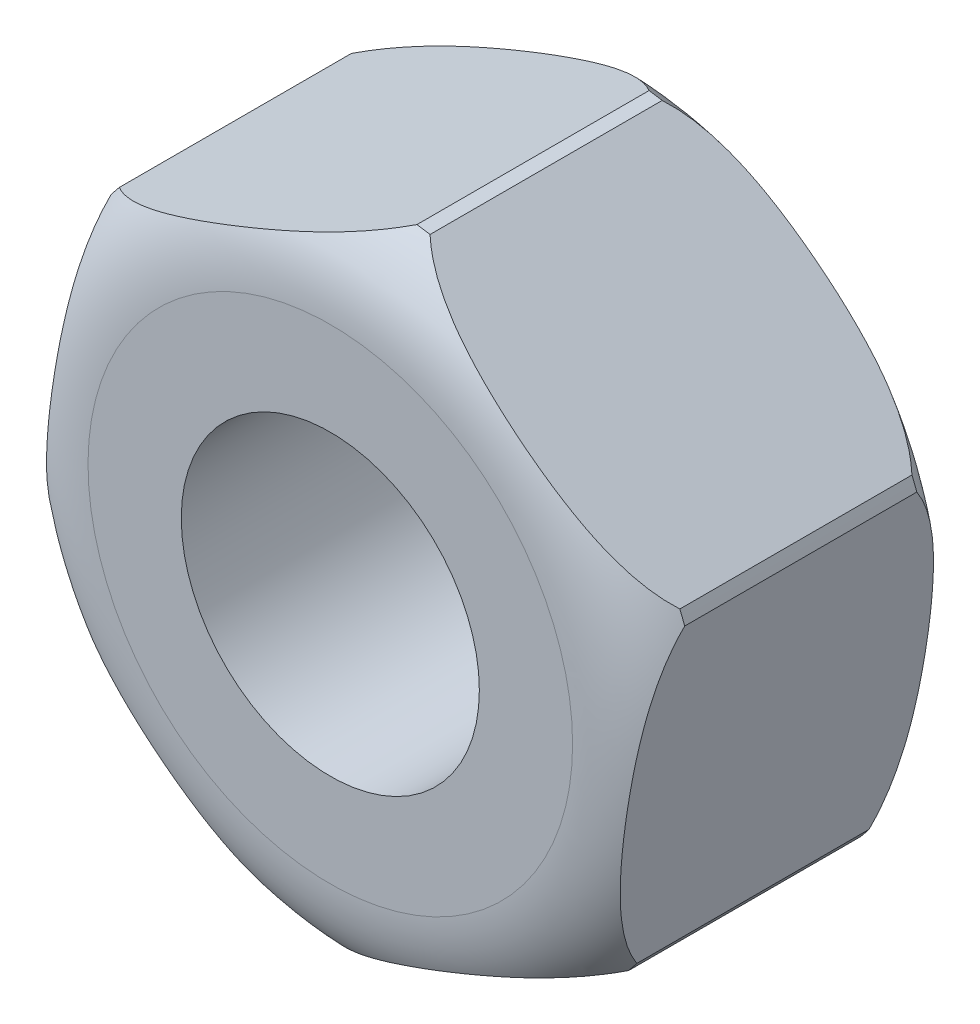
ISO-10303-21;
HEADER;
FILE_DESCRIPTION(('STEP AP214'),'2;1');
FILE_NAME('part.step','',(''),(''),'','','');
FILE_SCHEMA(('AUTOMOTIVE_DESIGN { 1 0 10303 214 1 1 1 1 }'));
ENDSEC;
DATA;
#1=APPLICATION_CONTEXT('core data for automotive mechanical design processes');
#2=APPLICATION_PROTOCOL_DEFINITION('international standard','automotive_design',2000,#1);
#3=PRODUCT_CONTEXT('',#1,'mechanical');
#4=PRODUCT('Part','Part','',(#3));
#5=PRODUCT_RELATED_PRODUCT_CATEGORY('part','',(#4));
#6=PRODUCT_DEFINITION_FORMATION('','',#4);
#7=PRODUCT_DEFINITION_CONTEXT('part definition',#1,'design');
#8=PRODUCT_DEFINITION('design','',#6,#7);
#9=PRODUCT_DEFINITION_SHAPE('','',#8);
#10=(LENGTH_UNIT() NAMED_UNIT(*) SI_UNIT(.MILLI.,.METRE.));
#11=(NAMED_UNIT(*) PLANE_ANGLE_UNIT() SI_UNIT($,.RADIAN.));
#12=(NAMED_UNIT(*) SI_UNIT($,.STERADIAN.) SOLID_ANGLE_UNIT());
#13=UNCERTAINTY_MEASURE_WITH_UNIT(LENGTH_MEASURE(1.E-05),#10,'distance_accuracy_value','');
#14=(GEOMETRIC_REPRESENTATION_CONTEXT(3) GLOBAL_UNCERTAINTY_ASSIGNED_CONTEXT((#13)) GLOBAL_UNIT_ASSIGNED_CONTEXT((#10,
#11,#12)) REPRESENTATION_CONTEXT('',''));
#15=CARTESIAN_POINT('',(0.,0.,0.));
#16=DIRECTION('',(0.,0.,1.));
#17=DIRECTION('',(1.,0.,0.));
#18=AXIS2_PLACEMENT_3D('',#15,#16,#17);
#19=CARTESIAN_POINT('',(0.,0.,3.));
#20=DIRECTION('',(0.,0.,1.));
#21=DIRECTION('',(1.,0.,0.));
#22=AXIS2_PLACEMENT_3D('',#19,#20,#21);
#23=PLANE('',#22);
#24=CARTESIAN_POINT('',(0.,0.,3.));
#25=DIRECTION('',(0.,0.,1.));
#26=DIRECTION('',(1.,0.,0.));
#27=AXIS2_PLACEMENT_3D('',#24,#25,#26);
#28=CIRCLE('',#27,1.4);
#29=CARTESIAN_POINT('',(1.4,0.,3.));
#30=VERTEX_POINT('',#29);
#31=EDGE_CURVE('E254',#30,#30,#28,.T.);
#32=ORIENTED_EDGE('',*,*,#31,.F.);
#33=EDGE_LOOP('',(#32));
#34=FACE_BOUND('',#33,.T.);
#35=CARTESIAN_POINT('',(0.,0.,3.));
#36=DIRECTION('',(0.,0.,1.));
#37=DIRECTION('',(1.,0.,0.));
#38=AXIS2_PLACEMENT_3D('',#35,#36,#37);
#39=CIRCLE('',#38,2.27578255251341);
#40=CARTESIAN_POINT('',(2.27578255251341,0.,3.));
#41=VERTEX_POINT('',#40);
#42=EDGE_CURVE('E175',#41,#41,#39,.T.);
#43=ORIENTED_EDGE('',*,*,#42,.T.);
#44=EDGE_LOOP('',(#43));
#45=FACE_BOUND('',#44,.T.);
#46=ADVANCED_FACE('F48',(#34,#45),#23,.T.);
#47=CARTESIAN_POINT('',(0.,0.,0.));
#48=DIRECTION('',(0.,0.,1.));
#49=DIRECTION('',(1.,0.,0.));
#50=AXIS2_PLACEMENT_3D('',#47,#48,#49);
#51=PLANE('',#50);
#52=CARTESIAN_POINT('',(0.,0.,0.));
#53=DIRECTION('',(0.,0.,1.));
#54=DIRECTION('',(1.,0.,0.));
#55=AXIS2_PLACEMENT_3D('',#52,#53,#54);
#56=CIRCLE('',#55,1.4);
#57=CARTESIAN_POINT('',(1.4,0.,0.));
#58=VERTEX_POINT('',#57);
#59=EDGE_CURVE('E260',#58,#58,#56,.T.);
#60=ORIENTED_EDGE('',*,*,#59,.T.);
#61=EDGE_LOOP('',(#60));
#62=FACE_BOUND('',#61,.T.);
#63=CARTESIAN_POINT('',(0.,0.,0.));
#64=DIRECTION('',(0.,0.,1.));
#65=DIRECTION('',(1.,0.,0.));
#66=AXIS2_PLACEMENT_3D('',#63,#64,#65);
#67=CIRCLE('',#66,2.27578255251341);
#68=CARTESIAN_POINT('',(2.27578255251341,0.,0.));
#69=VERTEX_POINT('',#68);
#70=EDGE_CURVE('E162',#69,#69,#67,.T.);
#71=ORIENTED_EDGE('',*,*,#70,.F.);
#72=EDGE_LOOP('',(#71));
#73=FACE_BOUND('',#72,.T.);
#74=ADVANCED_FACE('F402',(#62,#73),#51,.F.);
#75=CARTESIAN_POINT('',(0.,0.,0.));
#76=DIRECTION('',(0.,0.,1.));
#77=DIRECTION('',(1.,0.,0.));
#78=AXIS2_PLACEMENT_3D('',#75,#76,#77);
#79=CYLINDRICAL_SURFACE('',#78,1.4);
#80=ORIENTED_EDGE('',*,*,#59,.F.);
#81=EDGE_LOOP('',(#80));
#82=FACE_BOUND('',#81,.T.);
#83=ORIENTED_EDGE('',*,*,#31,.T.);
#84=EDGE_LOOP('',(#83));
#85=FACE_BOUND('',#84,.T.);
#86=ADVANCED_FACE('F409',(#82,#85),#79,.F.);
#87=CARTESIAN_POINT('',(0.,0.,3.));
#88=DIRECTION('',(0.,0.,1.));
#89=DIRECTION('',(1.,0.,0.));
#90=AXIS2_PLACEMENT_3D('',#87,#88,#89);
#91=CYLINDRICAL_SURFACE('',#90,3.11115542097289);
#92=DIRECTION('',(0.,0.,1.));
#93=VECTOR('',#92,1.);
#94=CARTESIAN_POINT('',(0.403593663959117,3.08486631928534,3.));
#95=LINE('',#94,#93);
#96=CARTESIAN_POINT('',(0.403593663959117,3.08486631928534,0.409852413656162));
#97=VERTEX_POINT('',#96);
#98=CARTESIAN_POINT('',(0.403593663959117,3.08486631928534,2.59014758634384));
#99=VERTEX_POINT('',#98);
#100=EDGE_CURVE('E249',#97,#99,#95,.T.);
#101=ORIENTED_EDGE('',*,*,#100,.T.);
#102=CARTESIAN_POINT('',(0.,0.,2.59014758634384));
#103=DIRECTION('',(0.,0.,1.));
#104=DIRECTION('',(1.,0.,0.));
#105=AXIS2_PLACEMENT_3D('',#102,#103,#104);
#106=CIRCLE('',#105,3.11115542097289);
#107=CARTESIAN_POINT('',(0.526999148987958,3.06619633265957,2.59014758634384));
#108=VERTEX_POINT('',#107);
#109=EDGE_CURVE('E221',#108,#99,#106,.T.);
#110=ORIENTED_EDGE('',*,*,#109,.F.);
#111=DIRECTION('',(0.,0.,1.));
#112=VECTOR('',#111,1.);
#113=CARTESIAN_POINT('',(0.526999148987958,3.06619633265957,3.));
#114=LINE('',#113,#112);
#115=CARTESIAN_POINT('',(0.526999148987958,3.06619633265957,0.409852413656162));
#116=VERTEX_POINT('',#115);
#117=EDGE_CURVE('E58',#108,#116,#114,.F.);
#118=ORIENTED_EDGE('',*,*,#117,.T.);
#119=CARTESIAN_POINT('',(0.,0.,0.409852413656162));
#120=DIRECTION('',(0.,0.,1.));
#121=DIRECTION('',(1.,0.,0.));
#122=AXIS2_PLACEMENT_3D('',#119,#120,#121);
#123=CIRCLE('',#122,3.11115542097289);
#124=EDGE_CURVE('E163',#116,#97,#123,.T.);
#125=ORIENTED_EDGE('',*,*,#124,.T.);
#126=EDGE_LOOP('',(#101,#110,#118,#125));
#127=FACE_BOUND('',#126,.T.);
#128=ADVANCED_FACE('F204',(#127),#91,.T.);
#129=DIRECTION('',(0.,0.,1.));
#130=VECTOR('',#129,1.);
#131=CARTESIAN_POINT('',(-2.39190434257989,1.98949281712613,3.));
#132=LINE('',#131,#130);
#133=CARTESIAN_POINT('',(-2.39190434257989,1.98949281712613,2.59014758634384));
#134=VERTEX_POINT('',#133);
#135=CARTESIAN_POINT('',(-2.39190434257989,1.98949281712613,0.409852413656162));
#136=VERTEX_POINT('',#135);
#137=EDGE_CURVE('E244',#134,#136,#132,.F.);
#138=ORIENTED_EDGE('',*,*,#137,.T.);
#139=CARTESIAN_POINT('',(-2.46977576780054,1.89195552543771,0.409852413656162));
#140=VERTEX_POINT('',#139);
#141=EDGE_CURVE('E273',#136,#140,#123,.T.);
#142=ORIENTED_EDGE('',*,*,#141,.T.);
#143=DIRECTION('',(0.,0.,1.));
#144=VECTOR('',#143,1.);
#145=CARTESIAN_POINT('',(-2.46977576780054,1.89195552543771,3.));
#146=LINE('',#145,#144);
#147=CARTESIAN_POINT('',(-2.46977576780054,1.89195552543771,2.59014758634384));
#148=VERTEX_POINT('',#147);
#149=EDGE_CURVE('E250',#140,#148,#146,.T.);
#150=ORIENTED_EDGE('',*,*,#149,.T.);
#151=EDGE_CURVE('E65',#134,#148,#106,.T.);
#152=ORIENTED_EDGE('',*,*,#151,.F.);
#153=EDGE_LOOP('',(#138,#142,#150,#152));
#154=FACE_BOUND('',#153,.T.);
#155=ADVANCED_FACE('F342',(#154),#91,.T.);
#156=DIRECTION('',(0.,0.,1.));
#157=VECTOR('',#156,1.);
#158=CARTESIAN_POINT('',(-2.91890349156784,-1.07670351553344,3.));
#159=LINE('',#158,#157);
#160=CARTESIAN_POINT('',(-2.91890349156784,-1.07670351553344,2.59014758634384));
#161=VERTEX_POINT('',#160);
#162=CARTESIAN_POINT('',(-2.91890349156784,-1.07670351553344,0.409852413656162));
#163=VERTEX_POINT('',#162);
#164=EDGE_CURVE('E256',#161,#163,#159,.F.);
#165=ORIENTED_EDGE('',*,*,#164,.T.);
#166=CARTESIAN_POINT('',(-2.87336943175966,-1.19291079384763,0.409852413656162));
#167=VERTEX_POINT('',#166);
#168=EDGE_CURVE('E338',#163,#167,#123,.T.);
#169=ORIENTED_EDGE('',*,*,#168,.T.);
#170=DIRECTION('',(0.,0.,1.));
#171=VECTOR('',#170,1.);
#172=CARTESIAN_POINT('',(-2.87336943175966,-1.19291079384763,3.));
#173=LINE('',#172,#171);
#174=CARTESIAN_POINT('',(-2.87336943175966,-1.19291079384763,2.59014758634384));
#175=VERTEX_POINT('',#174);
#176=EDGE_CURVE('E367',#167,#175,#173,.T.);
#177=ORIENTED_EDGE('',*,*,#176,.T.);
#178=EDGE_CURVE('E73',#161,#175,#106,.T.);
#179=ORIENTED_EDGE('',*,*,#178,.F.);
#180=EDGE_LOOP('',(#165,#169,#177,#179));
#181=FACE_BOUND('',#180,.T.);
#182=ADVANCED_FACE('F370',(#181),#91,.T.);
#183=DIRECTION('',(0.,0.,1.));
#184=VECTOR('',#183,1.);
#185=CARTESIAN_POINT('',(-0.526999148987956,-3.06619633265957,3.));
#186=LINE('',#185,#184);
#187=CARTESIAN_POINT('',(-0.526999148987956,-3.06619633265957,2.59014758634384));
#188=VERTEX_POINT('',#187);
#189=CARTESIAN_POINT('',(-0.526999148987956,-3.06619633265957,0.409852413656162));
#190=VERTEX_POINT('',#189);
#191=EDGE_CURVE('E364',#188,#190,#186,.F.);
#192=ORIENTED_EDGE('',*,*,#191,.T.);
#193=CARTESIAN_POINT('',(-0.403593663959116,-3.08486631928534,0.409852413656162));
#194=VERTEX_POINT('',#193);
#195=EDGE_CURVE('E373',#190,#194,#123,.T.);
#196=ORIENTED_EDGE('',*,*,#195,.T.);
#197=DIRECTION('',(0.,0.,1.));
#198=VECTOR('',#197,1.);
#199=CARTESIAN_POINT('',(-0.403593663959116,-3.08486631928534,3.));
#200=LINE('',#199,#198);
#201=CARTESIAN_POINT('',(-0.403593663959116,-3.08486631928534,2.59014758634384));
#202=VERTEX_POINT('',#201);
#203=EDGE_CURVE('E361',#194,#202,#200,.T.);
#204=ORIENTED_EDGE('',*,*,#203,.T.);
#205=EDGE_CURVE('E378',#188,#202,#106,.T.);
#206=ORIENTED_EDGE('',*,*,#205,.F.);
#207=EDGE_LOOP('',(#192,#196,#204,#206));
#208=FACE_BOUND('',#207,.T.);
#209=ADVANCED_FACE('F391',(#208),#91,.T.);
#210=DIRECTION('',(0.,0.,1.));
#211=VECTOR('',#210,1.);
#212=CARTESIAN_POINT('',(2.39190434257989,-1.98949281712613,3.));
#213=LINE('',#212,#211);
#214=CARTESIAN_POINT('',(2.39190434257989,-1.98949281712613,2.59014758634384));
#215=VERTEX_POINT('',#214);
#216=CARTESIAN_POINT('',(2.39190434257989,-1.98949281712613,0.409852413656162));
#217=VERTEX_POINT('',#216);
#218=EDGE_CURVE('E358',#215,#217,#213,.F.);
#219=ORIENTED_EDGE('',*,*,#218,.T.);
#220=CARTESIAN_POINT('',(2.46977576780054,-1.8919555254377,0.409852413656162));
#221=VERTEX_POINT('',#220);
#222=EDGE_CURVE('E165',#217,#221,#123,.T.);
#223=ORIENTED_EDGE('',*,*,#222,.T.);
#224=DIRECTION('',(0.,0.,1.));
#225=VECTOR('',#224,1.);
#226=CARTESIAN_POINT('',(2.46977576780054,-1.8919555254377,3.));
#227=LINE('',#226,#225);
#228=CARTESIAN_POINT('',(2.46977576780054,-1.8919555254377,2.59014758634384));
#229=VERTEX_POINT('',#228);
#230=EDGE_CURVE('E150',#221,#229,#227,.T.);
#231=ORIENTED_EDGE('',*,*,#230,.T.);
#232=EDGE_CURVE('E222',#215,#229,#106,.T.);
#233=ORIENTED_EDGE('',*,*,#232,.F.);
#234=EDGE_LOOP('',(#219,#223,#231,#233));
#235=FACE_BOUND('',#234,.T.);
#236=ADVANCED_FACE('F395',(#235),#91,.T.);
#237=DIRECTION('',(0.,0.,1.));
#238=VECTOR('',#237,1.);
#239=CARTESIAN_POINT('',(2.91890349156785,1.07670351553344,3.));
#240=LINE('',#239,#238);
#241=CARTESIAN_POINT('',(2.91890349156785,1.07670351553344,2.59014758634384));
#242=VERTEX_POINT('',#241);
#243=CARTESIAN_POINT('',(2.91890349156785,1.07670351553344,0.409852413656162));
#244=VERTEX_POINT('',#243);
#245=EDGE_CURVE('E138',#242,#244,#240,.F.);
#246=ORIENTED_EDGE('',*,*,#245,.T.);
#247=CARTESIAN_POINT('',(2.87336943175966,1.19291079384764,0.409852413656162));
#248=VERTEX_POINT('',#247);
#249=EDGE_CURVE('E141',#244,#248,#123,.T.);
#250=ORIENTED_EDGE('',*,*,#249,.T.);
#251=DIRECTION('',(0.,0.,1.));
#252=VECTOR('',#251,1.);
#253=CARTESIAN_POINT('',(2.87336943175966,1.19291079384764,3.));
#254=LINE('',#253,#252);
#255=CARTESIAN_POINT('',(2.87336943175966,1.19291079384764,2.59014758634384));
#256=VERTEX_POINT('',#255);
#257=EDGE_CURVE('E12',#248,#256,#254,.T.);
#258=ORIENTED_EDGE('',*,*,#257,.T.);
#259=EDGE_CURVE('E144',#242,#256,#106,.T.);
#260=ORIENTED_EDGE('',*,*,#259,.F.);
#261=EDGE_LOOP('',(#246,#250,#258,#260));
#262=FACE_BOUND('',#261,.T.);
#263=ADVANCED_FACE('F140',(#262),#91,.T.);
#264=CARTESIAN_POINT('',(0.,2.27578255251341,3.));
#265=CARTESIAN_POINT('',(0.,2.84273881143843,2.98501458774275));
#266=CARTESIAN_POINT('',(0.,3.11115542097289,2.59014758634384));
#267=B_SPLINE_CURVE_WITH_KNOTS('',2,(#264,#265,#266),.UNSPECIFIED.,.F.,.F.,(3,3),(0.,1.),.UNSPECIFIED.);
#268=CARTESIAN_POINT('',(0.,0.,3.));
#269=DIRECTION('',(0.,0.,1.));
#270=AXIS1_PLACEMENT('',#268,#269);
#271=SURFACE_OF_REVOLUTION('',#267,#270);
#272=ORIENTED_EDGE('',*,*,#42,.F.);
#273=EDGE_LOOP('',(#272));
#274=FACE_BOUND('',#273,.T.);
#275=CARTESIAN_POINT('',(0.403593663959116,3.08486631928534,2.59014758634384));
#276=CARTESIAN_POINT('',(0.373708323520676,3.07315620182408,2.61294414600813));
#277=CARTESIAN_POINT('',(0.342708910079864,3.06100955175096,2.63395894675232));
#278=CARTESIAN_POINT('',(0.279074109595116,3.03607522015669,2.67266343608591));
#279=CARTESIAN_POINT('',(0.246443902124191,3.02328956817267,2.69036289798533));
#280=CARTESIAN_POINT('',(0.180409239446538,2.99741488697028,2.72258631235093));
#281=CARTESIAN_POINT('',(0.147021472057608,2.98433239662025,2.73715037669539));
#282=CARTESIAN_POINT('',(0.0793715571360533,2.95782480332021,2.76377526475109));
#283=CARTESIAN_POINT('',(0.0451087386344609,2.94439943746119,2.77583409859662));
#284=CARTESIAN_POINT('',(-0.0481621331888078,2.90785266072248,2.80546424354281));
#285=CARTESIAN_POINT('',(-0.107729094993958,2.88451225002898,2.82099820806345));
#286=CARTESIAN_POINT('',(-0.227804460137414,2.83746253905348,2.84734779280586));
#287=CARTESIAN_POINT('',(-0.288314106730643,2.8137527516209,2.85815651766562));
#288=CARTESIAN_POINT('',(-0.409841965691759,2.76613390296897,2.87617766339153));
#289=CARTESIAN_POINT('',(-0.470860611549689,2.74222467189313,2.88338661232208));
#290=CARTESIAN_POINT('',(-0.593879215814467,2.69402169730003,2.89506533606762));
#291=CARTESIAN_POINT('',(-0.655881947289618,2.66972686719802,2.89949996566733));
#292=CARTESIAN_POINT('',(-0.779920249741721,2.62112433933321,2.90600568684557));
#293=CARTESIAN_POINT('',(-0.841955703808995,2.59681668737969,2.90807945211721));
#294=CARTESIAN_POINT('',(-0.966038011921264,2.54819691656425,2.91012082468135));
#295=CARTESIAN_POINT('',(-1.02808485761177,2.52388480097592,2.91008903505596));
#296=CARTESIAN_POINT('',(-1.14479508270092,2.47815366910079,2.90804301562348));
#297=CARTESIAN_POINT('',(-1.19946204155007,2.4567332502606,2.90626417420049));
#298=CARTESIAN_POINT('',(-1.30871820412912,2.41392287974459,2.9008989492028));
#299=CARTESIAN_POINT('',(-1.36330741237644,2.3925329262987,2.89731267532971));
#300=CARTESIAN_POINT('',(-1.47219490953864,2.34986701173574,2.88801757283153));
#301=CARTESIAN_POINT('',(-1.52649358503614,2.32859089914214,2.88231413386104));
#302=CARTESIAN_POINT('',(-1.6347929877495,2.28615542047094,2.86828258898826));
#303=CARTESIAN_POINT('',(-1.68879377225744,2.2649960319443,2.85995500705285));
#304=CARTESIAN_POINT('',(-1.78606917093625,2.22688014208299,2.84185726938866));
#305=CARTESIAN_POINT('',(-1.82943311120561,2.20988863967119,2.83266146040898));
#306=CARTESIAN_POINT('',(-1.9155871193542,2.17613049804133,2.81159533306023));
#307=CARTESIAN_POINT('',(-1.9583770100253,2.15936392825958,2.79972420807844));
#308=CARTESIAN_POINT('',(-2.08507024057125,2.1097211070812,2.75932150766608));
#309=CARTESIAN_POINT('',(-2.1678308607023,2.07729261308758,2.72591635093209));
#310=CARTESIAN_POINT('',(-2.27160949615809,2.03662852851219,2.66996685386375));
#311=CARTESIAN_POINT('',(-2.29641472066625,2.02690897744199,2.655435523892));
#312=CARTESIAN_POINT('',(-2.34500673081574,2.00786893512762,2.62434356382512));
#313=CARTESIAN_POINT('',(-2.3687898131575,1.99854989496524,2.60777627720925));
#314=CARTESIAN_POINT('',(-2.39190434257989,1.98949281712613,2.59014758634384));
#315=B_SPLINE_CURVE_WITH_KNOTS('',3,(#275,#276,#277,#278,#279,#280,#281,#282,#283,#284,#285,
#286,#287,#288,#289,#290,#291,#292,#293,#294,#295,#296,#297,#298,#299,#300,#301,#302,#303,#304,
#305,#306,#307,#308,#309,#310,#311,#312,#313,#314),.UNSPECIFIED.,.F.,.F.,(4,2,2,2,2,2,2,2,2,2,2,
2,2,2,2,2,2,2,2,4),(0.,0.117968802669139,0.235584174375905,0.351591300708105,0.467690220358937,
0.664928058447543,0.86245276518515,1.06016761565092,1.26033894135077,1.46028334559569,
1.66017048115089,1.83636869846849,2.01255622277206,2.18829826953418,2.36400524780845,
2.50634193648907,2.64872159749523,2.93175175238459,3.02271638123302,3.11398675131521),.UNSPECIFIED.);
#316=EDGE_CURVE('E151',#99,#134,#315,.T.);
#317=ORIENTED_EDGE('',*,*,#316,.T.);
#318=ORIENTED_EDGE('',*,*,#151,.T.);
#319=CARTESIAN_POINT('',(-2.46977576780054,1.8919555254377,2.59014758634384));
#320=CARTESIAN_POINT('',(-2.47457717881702,1.86021900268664,2.61294414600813));
#321=CARTESIAN_POINT('',(-2.47955757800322,1.82729939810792,2.63395894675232));
#322=CARTESIAN_POINT('',(-2.48978121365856,1.75972287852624,2.67266343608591));
#323=CARTESIAN_POINT('',(-2.49502361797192,1.72507146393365,2.69036289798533));
#324=CARTESIAN_POINT('',(-2.50563281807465,1.65494642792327,2.72258631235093));
#325=CARTESIAN_POINT('',(-2.51099693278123,1.6194905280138,2.73715037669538));
#326=CARTESIAN_POINT('',(-2.52186564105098,1.54765018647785,2.76377526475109));
#327=CARTESIAN_POINT('',(-2.52737034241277,1.51126503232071,2.77583409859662));
#328=CARTESIAN_POINT('',(-2.54235534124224,1.41221669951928,2.80546424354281));
#329=CARTESIAN_POINT('',(-2.55192543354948,1.34895999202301,2.82099820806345));
#330=CARTESIAN_POINT('',(-2.57121687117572,1.22144681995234,2.84734779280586));
#331=CARTESIAN_POINT('',(-2.58093841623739,1.1571890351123,2.85815651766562));
#332=CARTESIAN_POINT('',(-2.60046321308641,1.02813339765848,2.87617766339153));
#333=CARTESIAN_POINT('',(-2.61026653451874,0.963335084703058,2.88338661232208));
#334=CARTESIAN_POINT('',(-2.63003083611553,0.832696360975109,2.89506533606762));
#335=CARTESIAN_POINT('',(-2.63999226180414,0.766853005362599,2.89949996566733));
#336=CARTESIAN_POINT('',(-2.65992038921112,0.635131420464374,2.90600568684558));
#337=CARTESIAN_POINT('',(-2.66988707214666,0.569253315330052,2.90807945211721));
#338=CARTESIAN_POINT('',(-2.68982226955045,0.437484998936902,2.91012082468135));
#339=CARTESIAN_POINT('',(-2.69979078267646,0.371594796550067,2.91008903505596));
#340=CARTESIAN_POINT('',(-2.71854157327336,0.247655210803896,2.90804301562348));
#341=CARTESIAN_POINT('',(-2.72732442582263,0.189602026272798,2.90626417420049));
#342=CARTESIAN_POINT('',(-2.74487763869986,0.0735782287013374,2.9008989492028));
#343=CARTESIAN_POINT('',(-2.75364799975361,0.0156076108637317,2.89731267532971));
#344=CARTESIAN_POINT('',(-2.7711419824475,-0.100024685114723,2.88801757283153));
#345=CARTESIAN_POINT('',(-2.77986566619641,-0.157686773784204,2.88231413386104));
#346=CARTESIAN_POINT('',(-2.79726516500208,-0.272694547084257,2.86828258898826));
#347=CARTESIAN_POINT('',(-2.80594098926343,-0.330040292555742,2.85995500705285));
#348=CARTESIAN_POINT('',(-2.82156935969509,-0.433341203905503,2.84185726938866));
#349=CARTESIAN_POINT('',(-2.82853625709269,-0.479391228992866,2.83266146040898));
#350=CARTESIAN_POINT('',(-2.84237785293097,-0.57088185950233,2.81159533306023));
#351=CARTESIAN_POINT('',(-2.8492525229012,-0.616322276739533,2.79972420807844));
#352=CARTESIAN_POINT('',(-2.86960719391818,-0.750863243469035,2.75932150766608));
#353=CARTESIAN_POINT('',(-2.88290360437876,-0.838750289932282,2.72591635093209));
#354=CARTESIAN_POINT('',(-2.89957679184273,-0.948957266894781,2.66996685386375));
#355=CARTESIAN_POINT('',(-2.90356202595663,-0.97529899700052,2.655435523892));
#356=CARTESIAN_POINT('',(-2.911368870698,-1.02690093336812,2.62434356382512));
#357=CARTESIAN_POINT('',(-2.91518988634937,-1.05215720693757,2.60777627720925));
#358=CARTESIAN_POINT('',(-2.91890349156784,-1.07670351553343,2.59014758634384));
#359=B_SPLINE_CURVE_WITH_KNOTS('',3,(#319,#320,#321,#322,#323,#324,#325,#326,#327,#328,#329,
#330,#331,#332,#333,#334,#335,#336,#337,#338,#339,#340,#341,#342,#343,#344,#345,#346,#347,#348,
#349,#350,#351,#352,#353,#354,#355,#356,#357,#358),.UNSPECIFIED.,.F.,.F.,(4,2,2,2,2,2,2,2,2,2,2,
2,2,2,2,2,2,2,2,4),(0.,0.117968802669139,0.235584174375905,0.351591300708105,0.467690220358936,
0.664928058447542,0.862452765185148,1.06016761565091,1.26033894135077,1.46028334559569,
1.66017048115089,1.83636869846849,2.01255622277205,2.18829826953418,2.36400524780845,
2.50634193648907,2.64872159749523,2.93175175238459,3.02271638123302,3.11398675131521),.UNSPECIFIED.);
#360=EDGE_CURVE('E241',#148,#161,#359,.T.);
#361=ORIENTED_EDGE('',*,*,#360,.T.);
#362=ORIENTED_EDGE('',*,*,#178,.T.);
#363=CARTESIAN_POINT('',(-2.87336943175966,-1.19291079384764,2.59014758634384));
#364=CARTESIAN_POINT('',(-2.84828550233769,-1.21293719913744,2.61294414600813));
#365=CARTESIAN_POINT('',(-2.82226648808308,-1.23371015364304,2.63395894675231));
#366=CARTESIAN_POINT('',(-2.76885532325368,-1.27635234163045,2.67266343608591));
#367=CARTESIAN_POINT('',(-2.74146752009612,-1.29821810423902,2.69036289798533));
#368=CARTESIAN_POINT('',(-2.68604205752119,-1.34246845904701,2.72258631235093));
#369=CARTESIAN_POINT('',(-2.65801840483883,-1.36484186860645,2.73715037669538));
#370=CARTESIAN_POINT('',(-2.60123719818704,-1.41017461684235,2.76377526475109));
#371=CARTESIAN_POINT('',(-2.57247908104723,-1.43313440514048,2.77583409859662));
#372=CARTESIAN_POINT('',(-2.49419320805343,-1.49563596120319,2.80546424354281));
#373=CARTESIAN_POINT('',(-2.44419633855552,-1.53555225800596,2.82099820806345));
#374=CARTESIAN_POINT('',(-2.34341241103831,-1.61601571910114,2.84734779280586));
#375=CARTESIAN_POINT('',(-2.29262430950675,-1.65656371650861,2.85815651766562));
#376=CARTESIAN_POINT('',(-2.19062124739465,-1.7380005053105,2.87617766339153));
#377=CARTESIAN_POINT('',(-2.13940592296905,-1.77888958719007,2.88338661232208));
#378=CARTESIAN_POINT('',(-2.03615162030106,-1.86132533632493,2.89506533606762));
#379=CARTESIAN_POINT('',(-1.98411031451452,-1.90287386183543,2.89949996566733));
#380=CARTESIAN_POINT('',(-1.8800001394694,-1.98599291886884,2.90600568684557));
#381=CARTESIAN_POINT('',(-1.82793136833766,-2.02756337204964,2.90807945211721));
#382=CARTESIAN_POINT('',(-1.72378425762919,-2.11071191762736,2.91012082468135));
#383=CARTESIAN_POINT('',(-1.67170592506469,-2.15229000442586,2.91008903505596));
#384=CARTESIAN_POINT('',(-1.57374649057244,-2.2304984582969,2.90804301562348));
#385=CARTESIAN_POINT('',(-1.52786238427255,-2.26713122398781,2.90626417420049));
#386=CARTESIAN_POINT('',(-1.43615943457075,-2.34034465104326,2.9008989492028));
#387=CARTESIAN_POINT('',(-1.39034058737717,-2.37692531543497,2.89731267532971));
#388=CARTESIAN_POINT('',(-1.29894707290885,-2.44989169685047,2.88801757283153));
#389=CARTESIAN_POINT('',(-1.25337208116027,-2.48627767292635,2.88231413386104));
#390=CARTESIAN_POINT('',(-1.16247217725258,-2.5588499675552,2.86828258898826));
#391=CARTESIAN_POINT('',(-1.11714721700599,-2.59503632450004,2.85995500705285));
#392=CARTESIAN_POINT('',(-1.03550018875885,-2.6602213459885,2.84185726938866));
#393=CARTESIAN_POINT('',(-0.99910314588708,-2.68927986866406,2.83266146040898));
#394=CARTESIAN_POINT('',(-0.926790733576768,-2.74701235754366,2.81159533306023));
#395=CARTESIAN_POINT('',(-0.890875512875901,-2.77568620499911,2.79972420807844));
#396=CARTESIAN_POINT('',(-0.784536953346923,-2.86058435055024,2.75932150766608));
#397=CARTESIAN_POINT('',(-0.715072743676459,-2.91604290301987,2.72591635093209));
#398=CARTESIAN_POINT('',(-0.627967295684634,-2.98558579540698,2.66996685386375));
#399=CARTESIAN_POINT('',(-0.607147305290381,-3.00220797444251,2.655435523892));
#400=CARTESIAN_POINT('',(-0.566362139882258,-3.03476986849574,2.62434356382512));
#401=CARTESIAN_POINT('',(-0.54640007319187,-3.05070710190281,2.60777627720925));
#402=CARTESIAN_POINT('',(-0.526999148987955,-3.06619633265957,2.59014758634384));
#403=B_SPLINE_CURVE_WITH_KNOTS('',3,(#363,#364,#365,#366,#367,#368,#369,#370,#371,#372,#373,
#374,#375,#376,#377,#378,#379,#380,#381,#382,#383,#384,#385,#386,#387,#388,#389,#390,#391,#392,
#393,#394,#395,#396,#397,#398,#399,#400,#401,#402),.UNSPECIFIED.,.F.,.F.,(4,2,2,2,2,2,2,2,2,2,2,
2,2,2,2,2,2,2,2,4),(0.,0.117968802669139,0.235584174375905,0.351591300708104,0.467690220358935,
0.664928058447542,0.862452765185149,1.06016761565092,1.26033894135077,1.4602833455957,
1.6601704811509,1.8363686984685,2.01255622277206,2.18829826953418,2.36400524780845,
2.50634193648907,2.64872159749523,2.93175175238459,3.02271638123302,3.11398675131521),.UNSPECIFIED.);
#404=EDGE_CURVE('E283',#175,#188,#403,.T.);
#405=ORIENTED_EDGE('',*,*,#404,.T.);
#406=ORIENTED_EDGE('',*,*,#205,.T.);
#407=CARTESIAN_POINT('',(-0.403593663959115,-3.08486631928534,2.59014758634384));
#408=CARTESIAN_POINT('',(-0.373708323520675,-3.07315620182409,2.61294414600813));
#409=CARTESIAN_POINT('',(-0.342708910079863,-3.06100955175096,2.63395894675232));
#410=CARTESIAN_POINT('',(-0.279074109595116,-3.03607522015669,2.67266343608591));
#411=CARTESIAN_POINT('',(-0.246443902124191,-3.02328956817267,2.69036289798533));
#412=CARTESIAN_POINT('',(-0.180409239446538,-2.99741488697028,2.72258631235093));
#413=CARTESIAN_POINT('',(-0.147021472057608,-2.98433239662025,2.73715037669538));
#414=CARTESIAN_POINT('',(-0.0793715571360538,-2.95782480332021,2.76377526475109));
#415=CARTESIAN_POINT('',(-0.0451087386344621,-2.94439943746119,2.77583409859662));
#416=CARTESIAN_POINT('',(0.0481621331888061,-2.90785266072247,2.80546424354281));
#417=CARTESIAN_POINT('',(0.107729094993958,-2.88451225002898,2.82099820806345));
#418=CARTESIAN_POINT('',(0.227804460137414,-2.83746253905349,2.84734779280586));
#419=CARTESIAN_POINT('',(0.288314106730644,-2.8137527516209,2.85815651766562));
#420=CARTESIAN_POINT('',(0.409841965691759,-2.76613390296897,2.87617766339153));
#421=CARTESIAN_POINT('',(0.47086061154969,-2.74222467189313,2.88338661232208));
#422=CARTESIAN_POINT('',(0.593879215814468,-2.69402169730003,2.89506533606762));
#423=CARTESIAN_POINT('',(0.655881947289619,-2.66972686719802,2.89949996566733));
#424=CARTESIAN_POINT('',(0.779920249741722,-2.62112433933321,2.90600568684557));
#425=CARTESIAN_POINT('',(0.841955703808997,-2.59681668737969,2.90807945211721));
#426=CARTESIAN_POINT('',(0.966038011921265,-2.54819691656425,2.91012082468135));
#427=CARTESIAN_POINT('',(1.02808485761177,-2.52388480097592,2.91008903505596));
#428=CARTESIAN_POINT('',(1.14479508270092,-2.47815366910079,2.90804301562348));
#429=CARTESIAN_POINT('',(1.19946204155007,-2.4567332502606,2.90626417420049));
#430=CARTESIAN_POINT('',(1.30871820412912,-2.41392287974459,2.9008989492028));
#431=CARTESIAN_POINT('',(1.36330741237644,-2.3925329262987,2.89731267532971));
#432=CARTESIAN_POINT('',(1.47219490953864,-2.34986701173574,2.88801757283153));
#433=CARTESIAN_POINT('',(1.52649358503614,-2.32859089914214,2.88231413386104));
#434=CARTESIAN_POINT('',(1.6347929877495,-2.28615542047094,2.86828258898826));
#435=CARTESIAN_POINT('',(1.68879377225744,-2.2649960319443,2.85995500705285));
#436=CARTESIAN_POINT('',(1.78606917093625,-2.22688014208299,2.84185726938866));
#437=CARTESIAN_POINT('',(1.82943311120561,-2.20988863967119,2.83266146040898));
#438=CARTESIAN_POINT('',(1.9155871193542,-2.17613049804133,2.81159533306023));
#439=CARTESIAN_POINT('',(1.9583770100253,-2.15936392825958,2.79972420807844));
#440=CARTESIAN_POINT('',(2.08507024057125,-2.1097211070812,2.75932150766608));
#441=CARTESIAN_POINT('',(2.1678308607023,-2.07729261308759,2.72591635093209));
#442=CARTESIAN_POINT('',(2.27160949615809,-2.0366285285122,2.66996685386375));
#443=CARTESIAN_POINT('',(2.29641472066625,-2.02690897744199,2.655435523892));
#444=CARTESIAN_POINT('',(2.34500673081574,-2.00786893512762,2.62434356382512));
#445=CARTESIAN_POINT('',(2.3687898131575,-1.99854989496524,2.60777627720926));
#446=CARTESIAN_POINT('',(2.39190434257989,-1.98949281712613,2.59014758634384));
#447=B_SPLINE_CURVE_WITH_KNOTS('',3,(#407,#408,#409,#410,#411,#412,#413,#414,#415,#416,#417,
#418,#419,#420,#421,#422,#423,#424,#425,#426,#427,#428,#429,#430,#431,#432,#433,#434,#435,#436,
#437,#438,#439,#440,#441,#442,#443,#444,#445,#446),.UNSPECIFIED.,.F.,.F.,(4,2,2,2,2,2,2,2,2,2,2,
2,2,2,2,2,2,2,2,4),(0.,0.117968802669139,0.235584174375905,0.351591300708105,0.467690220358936,
0.664928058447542,0.862452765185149,1.06016761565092,1.26033894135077,1.46028334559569,
1.66017048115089,1.83636869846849,2.01255622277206,2.18829826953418,2.36400524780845,
2.50634193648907,2.64872159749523,2.93175175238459,3.02271638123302,3.11398675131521),.UNSPECIFIED.);
#448=EDGE_CURVE('E279',#202,#215,#447,.T.);
#449=ORIENTED_EDGE('',*,*,#448,.T.);
#450=ORIENTED_EDGE('',*,*,#232,.T.);
#451=CARTESIAN_POINT('',(2.46977576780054,-1.8919555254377,2.59014758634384));
#452=CARTESIAN_POINT('',(2.47457717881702,-1.86021900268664,2.61294414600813));
#453=CARTESIAN_POINT('',(2.47955757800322,-1.82729939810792,2.63395894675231));
#454=CARTESIAN_POINT('',(2.48978121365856,-1.75972287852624,2.67266343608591));
#455=CARTESIAN_POINT('',(2.49502361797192,-1.72507146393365,2.69036289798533));
#456=CARTESIAN_POINT('',(2.50563281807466,-1.65494642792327,2.72258631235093));
#457=CARTESIAN_POINT('',(2.51099693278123,-1.6194905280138,2.73715037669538));
#458=CARTESIAN_POINT('',(2.52186564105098,-1.54765018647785,2.76377526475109));
#459=CARTESIAN_POINT('',(2.52737034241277,-1.51126503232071,2.77583409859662));
#460=CARTESIAN_POINT('',(2.54235534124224,-1.41221669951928,2.80546424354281));
#461=CARTESIAN_POINT('',(2.55192543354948,-1.34895999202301,2.82099820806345));
#462=CARTESIAN_POINT('',(2.57121687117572,-1.22144681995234,2.84734779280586));
#463=CARTESIAN_POINT('',(2.58093841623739,-1.1571890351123,2.85815651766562));
#464=CARTESIAN_POINT('',(2.60046321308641,-1.02813339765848,2.87617766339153));
#465=CARTESIAN_POINT('',(2.61026653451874,-0.963335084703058,2.88338661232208));
#466=CARTESIAN_POINT('',(2.63003083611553,-0.832696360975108,2.89506533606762));
#467=CARTESIAN_POINT('',(2.63999226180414,-0.766853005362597,2.89949996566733));
#468=CARTESIAN_POINT('',(2.65992038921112,-0.635131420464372,2.90600568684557));
#469=CARTESIAN_POINT('',(2.66988707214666,-0.56925331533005,2.90807945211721));
#470=CARTESIAN_POINT('',(2.68982226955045,-0.4374849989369,2.91012082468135));
#471=CARTESIAN_POINT('',(2.69979078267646,-0.371594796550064,2.91008903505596));
#472=CARTESIAN_POINT('',(2.71854157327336,-0.247655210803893,2.90804301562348));
#473=CARTESIAN_POINT('',(2.72732442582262,-0.189602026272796,2.90626417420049));
#474=CARTESIAN_POINT('',(2.74487763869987,-0.0735782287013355,2.9008989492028));
#475=CARTESIAN_POINT('',(2.75364799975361,-0.0156076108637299,2.89731267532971));
#476=CARTESIAN_POINT('',(2.7711419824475,0.100024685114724,2.88801757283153));
#477=CARTESIAN_POINT('',(2.77986566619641,0.157686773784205,2.88231413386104));
#478=CARTESIAN_POINT('',(2.79726516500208,0.272694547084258,2.86828258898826));
#479=CARTESIAN_POINT('',(2.80594098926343,0.330040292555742,2.85995500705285));
#480=CARTESIAN_POINT('',(2.82156935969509,0.433341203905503,2.84185726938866));
#481=CARTESIAN_POINT('',(2.82853625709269,0.479391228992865,2.83266146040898));
#482=CARTESIAN_POINT('',(2.84237785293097,0.57088185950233,2.81159533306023));
#483=CARTESIAN_POINT('',(2.8492525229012,0.616322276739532,2.79972420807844));
#484=CARTESIAN_POINT('',(2.86960719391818,0.750863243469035,2.75932150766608));
#485=CARTESIAN_POINT('',(2.88290360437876,0.83875028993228,2.72591635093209));
#486=CARTESIAN_POINT('',(2.89957679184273,0.94895726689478,2.66996685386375));
#487=CARTESIAN_POINT('',(2.90356202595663,0.975298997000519,2.655435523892));
#488=CARTESIAN_POINT('',(2.911368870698,1.02690093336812,2.62434356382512));
#489=CARTESIAN_POINT('',(2.91518988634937,1.05215720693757,2.60777627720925));
#490=CARTESIAN_POINT('',(2.91890349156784,1.07670351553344,2.59014758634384));
#491=B_SPLINE_CURVE_WITH_KNOTS('',3,(#451,#452,#453,#454,#455,#456,#457,#458,#459,#460,#461,
#462,#463,#464,#465,#466,#467,#468,#469,#470,#471,#472,#473,#474,#475,#476,#477,#478,#479,#480,
#481,#482,#483,#484,#485,#486,#487,#488,#489,#490),.UNSPECIFIED.,.F.,.F.,(4,2,2,2,2,2,2,2,2,2,2,
2,2,2,2,2,2,2,2,4),(0.,0.117968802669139,0.235584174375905,0.351591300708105,0.467690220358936,
0.664928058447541,0.862452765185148,1.06016761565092,1.26033894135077,1.46028334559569,
1.66017048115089,1.83636869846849,2.01255622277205,2.18829826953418,2.36400524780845,
2.50634193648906,2.64872159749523,2.93175175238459,3.02271638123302,3.11398675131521),.UNSPECIFIED.);
#492=EDGE_CURVE('E276',#229,#242,#491,.T.);
#493=ORIENTED_EDGE('',*,*,#492,.T.);
#494=ORIENTED_EDGE('',*,*,#259,.T.);
#495=CARTESIAN_POINT('',(2.87336943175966,1.19291079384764,2.59014758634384));
#496=CARTESIAN_POINT('',(2.84828550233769,1.21293719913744,2.61294414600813));
#497=CARTESIAN_POINT('',(2.82226648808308,1.23371015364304,2.63395894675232));
#498=CARTESIAN_POINT('',(2.76885532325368,1.27635234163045,2.67266343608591));
#499=CARTESIAN_POINT('',(2.74146752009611,1.29821810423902,2.69036289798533));
#500=CARTESIAN_POINT('',(2.68604205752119,1.34246845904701,2.72258631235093));
#501=CARTESIAN_POINT('',(2.65801840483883,1.36484186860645,2.73715037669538));
#502=CARTESIAN_POINT('',(2.60123719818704,1.41017461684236,2.76377526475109));
#503=CARTESIAN_POINT('',(2.57247908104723,1.43313440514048,2.77583409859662));
#504=CARTESIAN_POINT('',(2.49419320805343,1.4956359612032,2.80546424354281));
#505=CARTESIAN_POINT('',(2.44419633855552,1.53555225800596,2.82099820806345));
#506=CARTESIAN_POINT('',(2.3434124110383,1.61601571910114,2.84734779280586));
#507=CARTESIAN_POINT('',(2.29262430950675,1.65656371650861,2.85815651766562));
#508=CARTESIAN_POINT('',(2.19062124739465,1.7380005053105,2.87617766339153));
#509=CARTESIAN_POINT('',(2.13940592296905,1.77888958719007,2.88338661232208));
#510=CARTESIAN_POINT('',(2.03615162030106,1.86132533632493,2.89506533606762));
#511=CARTESIAN_POINT('',(1.98411031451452,1.90287386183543,2.89949996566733));
#512=CARTESIAN_POINT('',(1.8800001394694,1.98599291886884,2.90600568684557));
#513=CARTESIAN_POINT('',(1.82793136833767,2.02756337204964,2.90807945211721));
#514=CARTESIAN_POINT('',(1.72378425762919,2.11071191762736,2.91012082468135));
#515=CARTESIAN_POINT('',(1.67170592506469,2.15229000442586,2.91008903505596));
#516=CARTESIAN_POINT('',(1.57374649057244,2.2304984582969,2.90804301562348));
#517=CARTESIAN_POINT('',(1.52786238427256,2.26713122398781,2.90626417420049));
#518=CARTESIAN_POINT('',(1.43615943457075,2.34034465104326,2.9008989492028));
#519=CARTESIAN_POINT('',(1.39034058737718,2.37692531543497,2.89731267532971));
#520=CARTESIAN_POINT('',(1.29894707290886,2.44989169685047,2.88801757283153));
#521=CARTESIAN_POINT('',(1.25337208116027,2.48627767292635,2.88231413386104));
#522=CARTESIAN_POINT('',(1.16247217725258,2.5588499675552,2.86828258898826));
#523=CARTESIAN_POINT('',(1.11714721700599,2.59503632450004,2.85995500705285));
#524=CARTESIAN_POINT('',(1.03550018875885,2.6602213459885,2.84185726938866));
#525=CARTESIAN_POINT('',(0.999103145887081,2.68927986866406,2.83266146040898));
#526=CARTESIAN_POINT('',(0.926790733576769,2.74701235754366,2.81159533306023));
#527=CARTESIAN_POINT('',(0.890875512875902,2.77568620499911,2.79972420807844));
#528=CARTESIAN_POINT('',(0.784536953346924,2.86058435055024,2.75932150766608));
#529=CARTESIAN_POINT('',(0.715072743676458,2.91604290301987,2.72591635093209));
#530=CARTESIAN_POINT('',(0.627967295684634,2.98558579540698,2.66996685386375));
#531=CARTESIAN_POINT('',(0.607147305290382,3.00220797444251,2.655435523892));
#532=CARTESIAN_POINT('',(0.566362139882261,3.03476986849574,2.62434356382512));
#533=CARTESIAN_POINT('',(0.546400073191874,3.05070710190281,2.60777627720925));
#534=CARTESIAN_POINT('',(0.526999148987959,3.06619633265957,2.59014758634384));
#535=B_SPLINE_CURVE_WITH_KNOTS('',3,(#495,#496,#497,#498,#499,#500,#501,#502,#503,#504,#505,
#506,#507,#508,#509,#510,#511,#512,#513,#514,#515,#516,#517,#518,#519,#520,#521,#522,#523,#524,
#525,#526,#527,#528,#529,#530,#531,#532,#533,#534),.UNSPECIFIED.,.F.,.F.,(4,2,2,2,2,2,2,2,2,2,2,
2,2,2,2,2,2,2,2,4),(0.,0.117968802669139,0.235584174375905,0.351591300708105,0.467690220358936,
0.664928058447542,0.862452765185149,1.06016761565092,1.26033894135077,1.46028334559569,
1.66017048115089,1.83636869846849,2.01255622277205,2.18829826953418,2.36400524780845,
2.50634193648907,2.64872159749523,2.93175175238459,3.02271638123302,3.11398675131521),.UNSPECIFIED.);
#536=EDGE_CURVE('E274',#256,#108,#535,.T.);
#537=ORIENTED_EDGE('',*,*,#536,.T.);
#538=ORIENTED_EDGE('',*,*,#109,.T.);
#539=EDGE_LOOP('',(#317,#318,#361,#362,#405,#406,#449,#450,#493,#494,#537,#538));
#540=FACE_BOUND('',#539,.T.);
#541=ADVANCED_FACE('F202',(#274,#540),#271,.F.);
#542=CARTESIAN_POINT('',(0.,3.11115542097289,0.409852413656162));
#543=CARTESIAN_POINT('',(0.,2.84273881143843,0.014985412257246));
#544=CARTESIAN_POINT('',(0.,2.27578255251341,0.));
#545=B_SPLINE_CURVE_WITH_KNOTS('',2,(#542,#543,#544),.UNSPECIFIED.,.F.,.F.,(3,3),(0.,1.),.UNSPECIFIED.);
#546=CARTESIAN_POINT('',(0.,0.,3.));
#547=DIRECTION('',(0.,0.,1.));
#548=AXIS1_PLACEMENT('',#546,#547);
#549=SURFACE_OF_REVOLUTION('',#545,#548);
#550=ORIENTED_EDGE('',*,*,#70,.T.);
#551=EDGE_LOOP('',(#550));
#552=FACE_BOUND('',#551,.T.);
#553=CARTESIAN_POINT('',(-2.39190434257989,1.98949281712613,0.409852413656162));
#554=CARTESIAN_POINT('',(-2.36201900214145,2.00120293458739,0.387055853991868));
#555=CARTESIAN_POINT('',(-2.33101958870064,2.01334958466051,0.366041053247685));
#556=CARTESIAN_POINT('',(-2.26738478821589,2.03828391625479,0.327336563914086));
#557=CARTESIAN_POINT('',(-2.23475458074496,2.0510695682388,0.309637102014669));
#558=CARTESIAN_POINT('',(-2.16871991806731,2.07694424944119,0.277413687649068));
#559=CARTESIAN_POINT('',(-2.13533215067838,2.09002673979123,0.262849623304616));
#560=CARTESIAN_POINT('',(-2.06768223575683,2.11653433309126,0.236224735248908));
#561=CARTESIAN_POINT('',(-2.03341941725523,2.12995969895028,0.224165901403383));
#562=CARTESIAN_POINT('',(-1.94014854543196,2.16650647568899,0.194535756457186));
#563=CARTESIAN_POINT('',(-1.88058158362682,2.18984688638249,0.179001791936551));
#564=CARTESIAN_POINT('',(-1.76050621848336,2.23689659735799,0.15265220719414));
#565=CARTESIAN_POINT('',(-1.69999657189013,2.26060638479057,0.141843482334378));
#566=CARTESIAN_POINT('',(-1.57846871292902,2.3082252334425,0.123822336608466));
#567=CARTESIAN_POINT('',(-1.51745006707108,2.33213446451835,0.116613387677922));
#568=CARTESIAN_POINT('',(-1.39443146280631,2.38033743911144,0.104934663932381));
#569=CARTESIAN_POINT('',(-1.33242873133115,2.40463226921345,0.100500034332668));
#570=CARTESIAN_POINT('',(-1.20839042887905,2.45323479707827,0.0939943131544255));
#571=CARTESIAN_POINT('',(-1.14635497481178,2.47754244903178,0.0919205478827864));
#572=CARTESIAN_POINT('',(-1.02227266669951,2.52616221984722,0.0898791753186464));
#573=CARTESIAN_POINT('',(-0.960225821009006,2.55047433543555,0.0899109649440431));
#574=CARTESIAN_POINT('',(-0.843515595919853,2.59620546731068,0.091956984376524));
#575=CARTESIAN_POINT('',(-0.788848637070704,2.61762588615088,0.0937358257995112));
#576=CARTESIAN_POINT('',(-0.679592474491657,2.66043625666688,0.099101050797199));
#577=CARTESIAN_POINT('',(-0.625003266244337,2.68182621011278,0.102687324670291));
#578=CARTESIAN_POINT('',(-0.516115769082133,2.72449212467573,0.111982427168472));
#579=CARTESIAN_POINT('',(-0.461817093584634,2.74576823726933,0.117685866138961));
#580=CARTESIAN_POINT('',(-0.353517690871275,2.78820371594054,0.131717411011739));
#581=CARTESIAN_POINT('',(-0.299516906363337,2.80936310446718,0.140044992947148));
#582=CARTESIAN_POINT('',(-0.202241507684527,2.84747899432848,0.158142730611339));
#583=CARTESIAN_POINT('',(-0.158877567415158,2.86447049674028,0.167338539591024));
#584=CARTESIAN_POINT('',(-0.0727235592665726,2.89822863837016,0.188404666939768));
#585=CARTESIAN_POINT('',(-0.0299336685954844,2.91499520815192,0.200275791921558));
#586=CARTESIAN_POINT('',(0.0967595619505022,2.96463802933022,0.24067849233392));
#587=CARTESIAN_POINT('',(0.179520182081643,2.99706652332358,0.274083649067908));
#588=CARTESIAN_POINT('',(0.283298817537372,3.03773060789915,0.330033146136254));
#589=CARTESIAN_POINT('',(0.308104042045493,3.04745015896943,0.344564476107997));
#590=CARTESIAN_POINT('',(0.356696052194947,3.0664902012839,0.375656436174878));
#591=CARTESIAN_POINT('',(0.380479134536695,3.07580924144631,0.392223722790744));
#592=CARTESIAN_POINT('',(0.403593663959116,3.08486631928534,0.409852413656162));
#593=B_SPLINE_CURVE_WITH_KNOTS('',3,(#553,#554,#555,#556,#557,#558,#559,#560,#561,#562,#563,
#564,#565,#566,#567,#568,#569,#570,#571,#572,#573,#574,#575,#576,#577,#578,#579,#580,#581,#582,
#583,#584,#585,#586,#587,#588,#589,#590,#591,#592),.UNSPECIFIED.,.F.,.F.,(4,2,2,2,2,2,2,2,2,2,2,
2,2,2,2,2,2,2,2,4),(0.,0.117968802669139,0.235584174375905,0.351591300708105,0.467690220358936,
0.664928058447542,0.862452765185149,1.06016761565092,1.26033894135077,1.46028334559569,
1.6601704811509,1.8363686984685,2.01255622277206,2.18829826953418,2.36400524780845,
2.50634193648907,2.64872159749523,2.93175175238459,3.02271638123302,3.11398675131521),.UNSPECIFIED.);
#594=EDGE_CURVE('E245',#136,#97,#593,.T.);
#595=ORIENTED_EDGE('',*,*,#594,.T.);
#596=ORIENTED_EDGE('',*,*,#124,.F.);
#597=CARTESIAN_POINT('',(0.526999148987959,3.06619633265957,0.409852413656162));
#598=CARTESIAN_POINT('',(0.552083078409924,3.04616992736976,0.387055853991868));
#599=CARTESIAN_POINT('',(0.578102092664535,3.02539697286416,0.366041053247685));
#600=CARTESIAN_POINT('',(0.631513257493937,2.98275478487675,0.327336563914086));
#601=CARTESIAN_POINT('',(0.658901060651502,2.96088902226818,0.309637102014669));
#602=CARTESIAN_POINT('',(0.714326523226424,2.9166386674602,0.277413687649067));
#603=CARTESIAN_POINT('',(0.742350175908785,2.89426525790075,0.262849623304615));
#604=CARTESIAN_POINT('',(0.799131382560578,2.84893250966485,0.236224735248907));
#605=CARTESIAN_POINT('',(0.827889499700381,2.82597272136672,0.224165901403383));
#606=CARTESIAN_POINT('',(0.906175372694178,2.763471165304,0.194535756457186));
#607=CARTESIAN_POINT('',(0.95617224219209,2.72355486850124,0.179001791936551));
#608=CARTESIAN_POINT('',(1.05695616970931,2.64309140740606,0.152652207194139));
#609=CARTESIAN_POINT('',(1.10774427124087,2.6025434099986,0.141843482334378));
#610=CARTESIAN_POINT('',(1.20974733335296,2.5211066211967,0.123822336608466));
#611=CARTESIAN_POINT('',(1.26096265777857,2.48021753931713,0.116613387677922));
#612=CARTESIAN_POINT('',(1.36421696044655,2.39778179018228,0.104934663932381));
#613=CARTESIAN_POINT('',(1.4162582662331,2.35623326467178,0.100500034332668));
#614=CARTESIAN_POINT('',(1.52036844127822,2.27311420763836,0.0939943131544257));
#615=CARTESIAN_POINT('',(1.57243721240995,2.23154375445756,0.0919205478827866));
#616=CARTESIAN_POINT('',(1.67658432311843,2.14839520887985,0.0898791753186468));
#617=CARTESIAN_POINT('',(1.72866265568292,2.10681712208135,0.0899109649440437));
#618=CARTESIAN_POINT('',(1.82662209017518,2.0286086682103,0.0919569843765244));
#619=CARTESIAN_POINT('',(1.87250619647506,1.9919759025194,0.0937358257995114));
#620=CARTESIAN_POINT('',(1.96420914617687,1.91876247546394,0.0991010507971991));
#621=CARTESIAN_POINT('',(2.01002799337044,1.88218181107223,0.102687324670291));
#622=CARTESIAN_POINT('',(2.10142150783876,1.80921542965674,0.111982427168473));
#623=CARTESIAN_POINT('',(2.14699649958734,1.77282945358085,0.117685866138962));
#624=CARTESIAN_POINT('',(2.23789640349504,1.70025715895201,0.131717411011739));
#625=CARTESIAN_POINT('',(2.28322136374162,1.66407080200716,0.140044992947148));
#626=CARTESIAN_POINT('',(2.36486839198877,1.59888578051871,0.158142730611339));
#627=CARTESIAN_POINT('',(2.40126543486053,1.56982725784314,0.167338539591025));
#628=CARTESIAN_POINT('',(2.47357784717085,1.51209476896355,0.188404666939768));
#629=CARTESIAN_POINT('',(2.50949306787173,1.48342092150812,0.200275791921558));
#630=CARTESIAN_POINT('',(2.61583162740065,1.39852277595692,0.240678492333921));
#631=CARTESIAN_POINT('',(2.68529583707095,1.34306422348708,0.274083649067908));
#632=CARTESIAN_POINT('',(2.77240128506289,1.27352133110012,0.330033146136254));
#633=CARTESIAN_POINT('',(2.7932212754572,1.25689915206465,0.344564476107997));
#634=CARTESIAN_POINT('',(2.83400644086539,1.22433725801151,0.375656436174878));
#635=CARTESIAN_POINT('',(2.85396850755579,1.20840002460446,0.392223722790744));
#636=CARTESIAN_POINT('',(2.87336943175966,1.19291079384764,0.409852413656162));
#637=B_SPLINE_CURVE_WITH_KNOTS('',3,(#597,#598,#599,#600,#601,#602,#603,#604,#605,#606,#607,
#608,#609,#610,#611,#612,#613,#614,#615,#616,#617,#618,#619,#620,#621,#622,#623,#624,#625,#626,
#627,#628,#629,#630,#631,#632,#633,#634,#635,#636),.UNSPECIFIED.,.F.,.F.,(4,2,2,2,2,2,2,2,2,2,2,
2,2,2,2,2,2,2,2,4),(0.,0.117968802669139,0.235584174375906,0.351591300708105,0.467690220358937,
0.664928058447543,0.86245276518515,1.06016761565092,1.26033894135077,1.46028334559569,
1.66017048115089,1.83636869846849,2.01255622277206,2.18829826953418,2.36400524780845,
2.50634193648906,2.64872159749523,2.93175175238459,3.02271638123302,3.11398675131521),.UNSPECIFIED.);
#638=EDGE_CURVE('E160',#116,#248,#637,.T.);
#639=ORIENTED_EDGE('',*,*,#638,.T.);
#640=ORIENTED_EDGE('',*,*,#249,.F.);
#641=CARTESIAN_POINT('',(2.91890349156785,1.07670351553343,0.409852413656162));
#642=CARTESIAN_POINT('',(2.91410208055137,1.04496699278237,0.387055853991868));
#643=CARTESIAN_POINT('',(2.90912168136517,1.01204738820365,0.366041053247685));
#644=CARTESIAN_POINT('',(2.89889804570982,0.944470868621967,0.327336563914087));
#645=CARTESIAN_POINT('',(2.89365564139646,0.909819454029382,0.309637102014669));
#646=CARTESIAN_POINT('',(2.88304644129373,0.839694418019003,0.277413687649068));
#647=CARTESIAN_POINT('',(2.87768232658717,0.804238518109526,0.262849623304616));
#648=CARTESIAN_POINT('',(2.8668136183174,0.732398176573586,0.236224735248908));
#649=CARTESIAN_POINT('',(2.86130891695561,0.696013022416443,0.224165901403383));
#650=CARTESIAN_POINT('',(2.84632391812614,0.596964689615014,0.194535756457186));
#651=CARTESIAN_POINT('',(2.8367538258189,0.533707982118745,0.179001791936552));
#652=CARTESIAN_POINT('',(2.81746238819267,0.406194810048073,0.15265220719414));
#653=CARTESIAN_POINT('',(2.807740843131,0.341937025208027,0.141843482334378));
#654=CARTESIAN_POINT('',(2.78821604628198,0.212881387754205,0.123822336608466));
#655=CARTESIAN_POINT('',(2.77841272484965,0.148083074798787,0.116613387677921));
#656=CARTESIAN_POINT('',(2.75864842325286,0.0174443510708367,0.104934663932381));
#657=CARTESIAN_POINT('',(2.74868699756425,-0.0483990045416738,0.100500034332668));
#658=CARTESIAN_POINT('',(2.72875887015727,-0.180120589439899,0.0939943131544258));
#659=CARTESIAN_POINT('',(2.71879218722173,-0.245998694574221,0.0919205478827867));
#660=CARTESIAN_POINT('',(2.69885698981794,-0.377767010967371,0.0898791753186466));
#661=CARTESIAN_POINT('',(2.68888847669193,-0.443657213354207,0.0899109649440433));
#662=CARTESIAN_POINT('',(2.67013768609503,-0.567596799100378,0.0919569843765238));
#663=CARTESIAN_POINT('',(2.66135483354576,-0.625649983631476,0.0937358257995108));
#664=CARTESIAN_POINT('',(2.64380162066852,-0.741673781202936,0.0991010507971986));
#665=CARTESIAN_POINT('',(2.63503125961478,-0.799644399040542,0.10268732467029));
#666=CARTESIAN_POINT('',(2.61753727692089,-0.915276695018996,0.111982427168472));
#667=CARTESIAN_POINT('',(2.60881359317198,-0.972938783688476,0.117685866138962));
#668=CARTESIAN_POINT('',(2.59141409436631,-1.08794655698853,0.131717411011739));
#669=CARTESIAN_POINT('',(2.58273827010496,-1.14529230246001,0.140044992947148));
#670=CARTESIAN_POINT('',(2.56710989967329,-1.24859321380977,0.158142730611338));
#671=CARTESIAN_POINT('',(2.56014300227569,-1.29464323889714,0.167338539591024));
#672=CARTESIAN_POINT('',(2.54630140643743,-1.3861338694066,0.188404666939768));
#673=CARTESIAN_POINT('',(2.53942673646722,-1.43157428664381,0.200275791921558));
#674=CARTESIAN_POINT('',(2.51907206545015,-1.5661152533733,0.24067849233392));
#675=CARTESIAN_POINT('',(2.5057756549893,-1.6540022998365,0.274083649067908));
#676=CARTESIAN_POINT('',(2.48910246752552,-1.76420927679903,0.330033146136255));
#677=CARTESIAN_POINT('',(2.48511723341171,-1.79055100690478,0.344564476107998));
#678=CARTESIAN_POINT('',(2.47731038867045,-1.8421529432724,0.375656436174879));
#679=CARTESIAN_POINT('',(2.4734893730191,-1.86740921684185,0.392223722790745));
#680=CARTESIAN_POINT('',(2.46977576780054,-1.8919555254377,0.409852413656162));
#681=B_SPLINE_CURVE_WITH_KNOTS('',3,(#641,#642,#643,#644,#645,#646,#647,#648,#649,#650,#651,
#652,#653,#654,#655,#656,#657,#658,#659,#660,#661,#662,#663,#664,#665,#666,#667,#668,#669,#670,
#671,#672,#673,#674,#675,#676,#677,#678,#679,#680),.UNSPECIFIED.,.F.,.F.,(4,2,2,2,2,2,2,2,2,2,2,
2,2,2,2,2,2,2,2,4),(0.,0.117968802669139,0.235584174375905,0.351591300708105,0.467690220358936,
0.664928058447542,0.862452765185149,1.06016761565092,1.26033894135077,1.46028334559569,
1.66017048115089,1.83636869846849,2.01255622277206,2.18829826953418,2.36400524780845,
2.50634193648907,2.64872159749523,2.93175175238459,3.02271638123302,3.11398675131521),.UNSPECIFIED.);
#682=EDGE_CURVE('E156',#244,#221,#681,.T.);
#683=ORIENTED_EDGE('',*,*,#682,.T.);
#684=ORIENTED_EDGE('',*,*,#222,.F.);
#685=CARTESIAN_POINT('',(2.39190434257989,-1.98949281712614,0.409852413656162));
#686=CARTESIAN_POINT('',(2.36201900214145,-2.00120293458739,0.387055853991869));
#687=CARTESIAN_POINT('',(2.33101958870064,-2.01334958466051,0.366041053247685));
#688=CARTESIAN_POINT('',(2.26738478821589,-2.03828391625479,0.327336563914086));
#689=CARTESIAN_POINT('',(2.23475458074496,-2.0510695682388,0.309637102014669));
#690=CARTESIAN_POINT('',(2.16871991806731,-2.07694424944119,0.277413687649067));
#691=CARTESIAN_POINT('',(2.13533215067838,-2.09002673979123,0.262849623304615));
#692=CARTESIAN_POINT('',(2.06768223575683,-2.11653433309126,0.236224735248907));
#693=CARTESIAN_POINT('',(2.03341941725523,-2.12995969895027,0.224165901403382));
#694=CARTESIAN_POINT('',(1.94014854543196,-2.16650647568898,0.194535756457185));
#695=CARTESIAN_POINT('',(1.88058158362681,-2.18984688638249,0.179001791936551));
#696=CARTESIAN_POINT('',(1.76050621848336,-2.23689659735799,0.15265220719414));
#697=CARTESIAN_POINT('',(1.69999657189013,-2.26060638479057,0.141843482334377));
#698=CARTESIAN_POINT('',(1.57846871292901,-2.3082252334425,0.123822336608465));
#699=CARTESIAN_POINT('',(1.51745006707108,-2.33213446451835,0.116613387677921));
#700=CARTESIAN_POINT('',(1.39443146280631,-2.38033743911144,0.104934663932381));
#701=CARTESIAN_POINT('',(1.33242873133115,-2.40463226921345,0.100500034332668));
#702=CARTESIAN_POINT('',(1.20839042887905,-2.45323479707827,0.0939943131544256));
#703=CARTESIAN_POINT('',(1.14635497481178,-2.47754244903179,0.0919205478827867));
#704=CARTESIAN_POINT('',(1.02227266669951,-2.52616221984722,0.0898791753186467));
#705=CARTESIAN_POINT('',(0.960225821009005,-2.55047433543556,0.0899109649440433));
#706=CARTESIAN_POINT('',(0.843515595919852,-2.59620546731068,0.0919569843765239));
#707=CARTESIAN_POINT('',(0.788848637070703,-2.61762588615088,0.0937358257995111));
#708=CARTESIAN_POINT('',(0.679592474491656,-2.66043625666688,0.0991010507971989));
#709=CARTESIAN_POINT('',(0.625003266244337,-2.68182621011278,0.10268732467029));
#710=CARTESIAN_POINT('',(0.516115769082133,-2.72449212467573,0.111982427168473));
#711=CARTESIAN_POINT('',(0.461817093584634,-2.74576823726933,0.117685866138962));
#712=CARTESIAN_POINT('',(0.353517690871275,-2.78820371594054,0.131717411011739));
#713=CARTESIAN_POINT('',(0.299516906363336,-2.80936310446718,0.140044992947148));
#714=CARTESIAN_POINT('',(0.202241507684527,-2.84747899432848,0.158142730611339));
#715=CARTESIAN_POINT('',(0.158877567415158,-2.86447049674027,0.167338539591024));
#716=CARTESIAN_POINT('',(0.0727235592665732,-2.89822863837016,0.188404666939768));
#717=CARTESIAN_POINT('',(0.0299336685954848,-2.91499520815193,0.200275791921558));
#718=CARTESIAN_POINT('',(-0.0967595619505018,-2.96463802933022,0.24067849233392));
#719=CARTESIAN_POINT('',(-0.179520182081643,-2.99706652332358,0.274083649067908));
#720=CARTESIAN_POINT('',(-0.283298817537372,-3.03773060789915,0.330033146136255));
#721=CARTESIAN_POINT('',(-0.308104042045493,-3.04745015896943,0.344564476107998));
#722=CARTESIAN_POINT('',(-0.356696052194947,-3.0664902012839,0.375656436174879));
#723=CARTESIAN_POINT('',(-0.380479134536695,-3.07580924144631,0.392223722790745));
#724=CARTESIAN_POINT('',(-0.403593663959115,-3.08486631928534,0.409852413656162));
#725=B_SPLINE_CURVE_WITH_KNOTS('',3,(#685,#686,#687,#688,#689,#690,#691,#692,#693,#694,#695,
#696,#697,#698,#699,#700,#701,#702,#703,#704,#705,#706,#707,#708,#709,#710,#711,#712,#713,#714,
#715,#716,#717,#718,#719,#720,#721,#722,#723,#724),.UNSPECIFIED.,.F.,.F.,(4,2,2,2,2,2,2,2,2,2,2,
2,2,2,2,2,2,2,2,4),(0.,0.117968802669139,0.235584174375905,0.351591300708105,0.467690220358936,
0.664928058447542,0.862452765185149,1.06016761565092,1.26033894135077,1.46028334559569,
1.6601704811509,1.8363686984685,2.01255622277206,2.18829826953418,2.36400524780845,
2.50634193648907,2.64872159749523,2.93175175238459,3.02271638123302,3.11398675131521),.UNSPECIFIED.);
#726=EDGE_CURVE('E169',#217,#194,#725,.T.);
#727=ORIENTED_EDGE('',*,*,#726,.T.);
#728=ORIENTED_EDGE('',*,*,#195,.F.);
#729=CARTESIAN_POINT('',(-0.526999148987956,-3.06619633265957,0.409852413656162));
#730=CARTESIAN_POINT('',(-0.552083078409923,-3.04616992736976,0.387055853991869));
#731=CARTESIAN_POINT('',(-0.578102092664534,-3.02539697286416,0.366041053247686));
#732=CARTESIAN_POINT('',(-0.631513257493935,-2.98275478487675,0.327336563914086));
#733=CARTESIAN_POINT('',(-0.658901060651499,-2.96088902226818,0.309637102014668));
#734=CARTESIAN_POINT('',(-0.714326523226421,-2.9166386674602,0.277413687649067));
#735=CARTESIAN_POINT('',(-0.742350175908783,-2.89426525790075,0.262849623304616));
#736=CARTESIAN_POINT('',(-0.799131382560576,-2.84893250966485,0.236224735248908));
#737=CARTESIAN_POINT('',(-0.827889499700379,-2.82597272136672,0.224165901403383));
#738=CARTESIAN_POINT('',(-0.906175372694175,-2.763471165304,0.194535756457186));
#739=CARTESIAN_POINT('',(-0.956172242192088,-2.72355486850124,0.179001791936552));
#740=CARTESIAN_POINT('',(-1.05695616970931,-2.64309140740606,0.15265220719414));
#741=CARTESIAN_POINT('',(-1.10774427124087,-2.6025434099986,0.141843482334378));
#742=CARTESIAN_POINT('',(-1.20974733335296,-2.5211066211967,0.123822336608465));
#743=CARTESIAN_POINT('',(-1.26096265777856,-2.48021753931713,0.116613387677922));
#744=CARTESIAN_POINT('',(-1.36421696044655,-2.39778179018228,0.104934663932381));
#745=CARTESIAN_POINT('',(-1.41625826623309,-2.35623326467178,0.100500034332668));
#746=CARTESIAN_POINT('',(-1.52036844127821,-2.27311420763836,0.0939943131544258));
#747=CARTESIAN_POINT('',(-1.57243721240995,-2.23154375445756,0.0919205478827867));
#748=CARTESIAN_POINT('',(-1.67658432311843,-2.14839520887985,0.0898791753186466));
#749=CARTESIAN_POINT('',(-1.72866265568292,-2.10681712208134,0.0899109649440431));
#750=CARTESIAN_POINT('',(-1.82662209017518,-2.0286086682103,0.0919569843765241));
#751=CARTESIAN_POINT('',(-1.87250619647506,-1.9919759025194,0.0937358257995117));
#752=CARTESIAN_POINT('',(-1.96420914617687,-1.91876247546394,0.0991010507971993));
#753=CARTESIAN_POINT('',(-2.01002799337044,-1.88218181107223,0.10268732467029));
#754=CARTESIAN_POINT('',(-2.10142150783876,-1.80921542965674,0.111982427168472));
#755=CARTESIAN_POINT('',(-2.14699649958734,-1.77282945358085,0.117685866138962));
#756=CARTESIAN_POINT('',(-2.23789640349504,-1.70025715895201,0.13171741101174));
#757=CARTESIAN_POINT('',(-2.28322136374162,-1.66407080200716,0.140044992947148));
#758=CARTESIAN_POINT('',(-2.36486839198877,-1.59888578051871,0.158142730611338));
#759=CARTESIAN_POINT('',(-2.40126543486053,-1.56982725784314,0.167338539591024));
#760=CARTESIAN_POINT('',(-2.47357784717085,-1.51209476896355,0.188404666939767));
#761=CARTESIAN_POINT('',(-2.50949306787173,-1.48342092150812,0.200275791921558));
#762=CARTESIAN_POINT('',(-2.61583162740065,-1.39852277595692,0.240678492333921));
#763=CARTESIAN_POINT('',(-2.68529583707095,-1.34306422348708,0.274083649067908));
#764=CARTESIAN_POINT('',(-2.77240128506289,-1.27352133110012,0.330033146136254));
#765=CARTESIAN_POINT('',(-2.7932212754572,-1.25689915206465,0.344564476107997));
#766=CARTESIAN_POINT('',(-2.83400644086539,-1.22433725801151,0.375656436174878));
#767=CARTESIAN_POINT('',(-2.85396850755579,-1.20840002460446,0.392223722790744));
#768=CARTESIAN_POINT('',(-2.87336943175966,-1.19291079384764,0.409852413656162));
#769=B_SPLINE_CURVE_WITH_KNOTS('',3,(#729,#730,#731,#732,#733,#734,#735,#736,#737,#738,#739,
#740,#741,#742,#743,#744,#745,#746,#747,#748,#749,#750,#751,#752,#753,#754,#755,#756,#757,#758,
#759,#760,#761,#762,#763,#764,#765,#766,#767,#768),.UNSPECIFIED.,.F.,.F.,(4,2,2,2,2,2,2,2,2,2,2,
2,2,2,2,2,2,2,2,4),(0.,0.117968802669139,0.235584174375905,0.351591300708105,0.467690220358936,
0.664928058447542,0.86245276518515,1.06016761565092,1.26033894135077,1.46028334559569,
1.6601704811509,1.8363686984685,2.01255622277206,2.18829826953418,2.36400524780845,
2.50634193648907,2.64872159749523,2.93175175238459,3.02271638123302,3.11398675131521),.UNSPECIFIED.);
#770=EDGE_CURVE('E173',#190,#167,#769,.T.);
#771=ORIENTED_EDGE('',*,*,#770,.T.);
#772=ORIENTED_EDGE('',*,*,#168,.F.);
#773=CARTESIAN_POINT('',(-2.91890349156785,-1.07670351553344,0.409852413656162));
#774=CARTESIAN_POINT('',(-2.91410208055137,-1.04496699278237,0.387055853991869));
#775=CARTESIAN_POINT('',(-2.90912168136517,-1.01204738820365,0.366041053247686));
#776=CARTESIAN_POINT('',(-2.89889804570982,-0.944470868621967,0.327336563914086));
#777=CARTESIAN_POINT('',(-2.89365564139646,-0.909819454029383,0.309637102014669));
#778=CARTESIAN_POINT('',(-2.88304644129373,-0.839694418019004,0.277413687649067));
#779=CARTESIAN_POINT('',(-2.87768232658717,-0.804238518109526,0.262849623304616));
#780=CARTESIAN_POINT('',(-2.8668136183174,-0.732398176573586,0.236224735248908));
#781=CARTESIAN_POINT('',(-2.86130891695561,-0.696013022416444,0.224165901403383));
#782=CARTESIAN_POINT('',(-2.84632391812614,-0.596964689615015,0.194535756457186));
#783=CARTESIAN_POINT('',(-2.8367538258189,-0.533707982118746,0.179001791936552));
#784=CARTESIAN_POINT('',(-2.81746238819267,-0.406194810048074,0.15265220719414));
#785=CARTESIAN_POINT('',(-2.807740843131,-0.341937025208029,0.141843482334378));
#786=CARTESIAN_POINT('',(-2.78821604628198,-0.212881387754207,0.123822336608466));
#787=CARTESIAN_POINT('',(-2.77841272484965,-0.148083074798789,0.116613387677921));
#788=CARTESIAN_POINT('',(-2.75864842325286,-0.0174443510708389,0.104934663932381));
#789=CARTESIAN_POINT('',(-2.74868699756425,0.0483990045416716,0.100500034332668));
#790=CARTESIAN_POINT('',(-2.72875887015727,0.180120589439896,0.0939943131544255));
#791=CARTESIAN_POINT('',(-2.71879218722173,0.245998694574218,0.0919205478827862));
#792=CARTESIAN_POINT('',(-2.69885698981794,0.377767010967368,0.0898791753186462));
#793=CARTESIAN_POINT('',(-2.68888847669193,0.443657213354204,0.0899109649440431));
#794=CARTESIAN_POINT('',(-2.67013768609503,0.567596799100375,0.091956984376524));
#795=CARTESIAN_POINT('',(-2.66135483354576,0.625649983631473,0.0937358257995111));
#796=CARTESIAN_POINT('',(-2.64380162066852,0.741673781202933,0.0991010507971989));
#797=CARTESIAN_POINT('',(-2.63503125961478,0.799644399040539,0.10268732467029));
#798=CARTESIAN_POINT('',(-2.61753727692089,0.915276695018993,0.111982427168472));
#799=CARTESIAN_POINT('',(-2.60881359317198,0.972938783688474,0.117685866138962));
#800=CARTESIAN_POINT('',(-2.59141409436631,1.08794655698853,0.131717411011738));
#801=CARTESIAN_POINT('',(-2.58273827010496,1.14529230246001,0.140044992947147));
#802=CARTESIAN_POINT('',(-2.56710989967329,1.24859321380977,0.158142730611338));
#803=CARTESIAN_POINT('',(-2.56014300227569,1.29464323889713,0.167338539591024));
#804=CARTESIAN_POINT('',(-2.54630140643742,1.3861338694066,0.188404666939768));
#805=CARTESIAN_POINT('',(-2.53942673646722,1.43157428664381,0.200275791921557));
#806=CARTESIAN_POINT('',(-2.51907206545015,1.5661152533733,0.240678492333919));
#807=CARTESIAN_POINT('',(-2.50577565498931,1.6540022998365,0.274083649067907));
#808=CARTESIAN_POINT('',(-2.48910246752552,1.76420927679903,0.330033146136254));
#809=CARTESIAN_POINT('',(-2.48511723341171,1.79055100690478,0.344564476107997));
#810=CARTESIAN_POINT('',(-2.47731038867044,1.8421529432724,0.375656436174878));
#811=CARTESIAN_POINT('',(-2.4734893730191,1.86740921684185,0.392223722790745));
#812=CARTESIAN_POINT('',(-2.46977576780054,1.8919555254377,0.409852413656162));
#813=B_SPLINE_CURVE_WITH_KNOTS('',3,(#773,#774,#775,#776,#777,#778,#779,#780,#781,#782,#783,
#784,#785,#786,#787,#788,#789,#790,#791,#792,#793,#794,#795,#796,#797,#798,#799,#800,#801,#802,
#803,#804,#805,#806,#807,#808,#809,#810,#811,#812),.UNSPECIFIED.,.F.,.F.,(4,2,2,2,2,2,2,2,2,2,2,
2,2,2,2,2,2,2,2,4),(0.,0.117968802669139,0.235584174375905,0.351591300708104,0.467690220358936,
0.664928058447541,0.862452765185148,1.06016761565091,1.26033894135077,1.46028334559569,
1.66017048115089,1.83636869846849,2.01255622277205,2.18829826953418,2.36400524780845,
2.50634193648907,2.64872159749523,2.93175175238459,3.02271638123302,3.11398675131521),.UNSPECIFIED.);
#814=EDGE_CURVE('E324',#163,#140,#813,.T.);
#815=ORIENTED_EDGE('',*,*,#814,.T.);
#816=ORIENTED_EDGE('',*,*,#141,.F.);
#817=EDGE_LOOP('',(#595,#596,#639,#640,#683,#684,#727,#728,#771,#772,#815,#816));
#818=FACE_BOUND('',#817,.T.);
#819=ADVANCED_FACE('F154',(#552,#818),#549,.F.);
#820=CARTESIAN_POINT('',(2.929682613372,1.14795170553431,3.));
#821=DIRECTION('',(-0.62392084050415,-0.781487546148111,0.));
#822=DIRECTION('',(0.781487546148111,-0.62392084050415,0.));
#823=AXIS2_PLACEMENT_3D('',#820,#821,#822);
#824=PLANE('',#823);
#825=ORIENTED_EDGE('',*,*,#257,.F.);
#826=ORIENTED_EDGE('',*,*,#638,.F.);
#827=ORIENTED_EDGE('',*,*,#117,.F.);
#828=ORIENTED_EDGE('',*,*,#536,.F.);
#829=EDGE_LOOP('',(#825,#826,#827,#828));
#830=FACE_BOUND('',#829,.T.);
#831=ADVANCED_FACE('F201',(#830),#824,.F.);
#832=CARTESIAN_POINT('',(2.45899664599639,-1.96320371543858,3.));
#833=DIRECTION('',(-0.988748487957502,0.149587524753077,0.));
#834=DIRECTION('',(-0.149587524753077,-0.988748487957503,0.));
#835=AXIS2_PLACEMENT_3D('',#832,#833,#834);
#836=PLANE('',#835);
#837=ORIENTED_EDGE('',*,*,#230,.F.);
#838=ORIENTED_EDGE('',*,*,#682,.F.);
#839=ORIENTED_EDGE('',*,*,#245,.F.);
#840=ORIENTED_EDGE('',*,*,#492,.F.);
#841=EDGE_LOOP('',(#837,#838,#839,#840));
#842=FACE_BOUND('',#841,.T.);
#843=ADVANCED_FACE('F167',(#842),#836,.F.);
#844=CARTESIAN_POINT('',(-0.470685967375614,-3.11115542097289,3.));
#845=DIRECTION('',(-0.364827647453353,0.931075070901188,0.));
#846=DIRECTION('',(-0.931075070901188,-0.364827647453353,0.));
#847=AXIS2_PLACEMENT_3D('',#844,#845,#846);
#848=PLANE('',#847);
#849=ORIENTED_EDGE('',*,*,#203,.F.);
#850=ORIENTED_EDGE('',*,*,#726,.F.);
#851=ORIENTED_EDGE('',*,*,#218,.F.);
#852=ORIENTED_EDGE('',*,*,#448,.F.);
#853=EDGE_LOOP('',(#849,#850,#851,#852));
#854=FACE_BOUND('',#853,.T.);
#855=ADVANCED_FACE('F306',(#854),#848,.F.);
#856=CARTESIAN_POINT('',(-2.929682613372,-1.14795170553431,3.));
#857=DIRECTION('',(0.62392084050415,0.781487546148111,0.));
#858=DIRECTION('',(-0.781487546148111,0.62392084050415,0.));
#859=AXIS2_PLACEMENT_3D('',#856,#857,#858);
#860=PLANE('',#859);
#861=ORIENTED_EDGE('',*,*,#176,.F.);
#862=ORIENTED_EDGE('',*,*,#770,.F.);
#863=ORIENTED_EDGE('',*,*,#191,.F.);
#864=ORIENTED_EDGE('',*,*,#404,.F.);
#865=EDGE_LOOP('',(#861,#862,#863,#864));
#866=FACE_BOUND('',#865,.T.);
#867=ADVANCED_FACE('F309',(#866),#860,.F.);
#868=CARTESIAN_POINT('',(-2.45899664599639,1.96320371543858,3.));
#869=DIRECTION('',(0.988748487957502,-0.149587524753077,0.));
#870=DIRECTION('',(0.149587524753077,0.988748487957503,0.));
#871=AXIS2_PLACEMENT_3D('',#868,#869,#870);
#872=PLANE('',#871);
#873=ORIENTED_EDGE('',*,*,#149,.F.);
#874=ORIENTED_EDGE('',*,*,#814,.F.);
#875=ORIENTED_EDGE('',*,*,#164,.F.);
#876=ORIENTED_EDGE('',*,*,#360,.F.);
#877=EDGE_LOOP('',(#873,#874,#875,#876));
#878=FACE_BOUND('',#877,.T.);
#879=ADVANCED_FACE('F314',(#878),#872,.F.);
#880=CARTESIAN_POINT('',(0.470685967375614,3.11115542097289,3.));
#881=DIRECTION('',(0.364827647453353,-0.931075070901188,0.));
#882=DIRECTION('',(0.931075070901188,0.364827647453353,0.));
#883=AXIS2_PLACEMENT_3D('',#880,#881,#882);
#884=PLANE('',#883);
#885=ORIENTED_EDGE('',*,*,#100,.F.);
#886=ORIENTED_EDGE('',*,*,#594,.F.);
#887=ORIENTED_EDGE('',*,*,#137,.F.);
#888=ORIENTED_EDGE('',*,*,#316,.F.);
#889=EDGE_LOOP('',(#885,#886,#887,#888));
#890=FACE_BOUND('',#889,.T.);
#891=ADVANCED_FACE('F50',(#890),#884,.F.);
#892=CLOSED_SHELL('',(#46,#74,#86,#128,#155,#182,#209,#236,#263,#541,#819,#831,#843,#855,#867,
#879,#891));
#893=MANIFOLD_SOLID_BREP('B2',#892);
#894=ADVANCED_BREP_SHAPE_REPRESENTATION('',(#18,#893),#14);
#895=SHAPE_DEFINITION_REPRESENTATION(#9,#894);
ENDSEC;
END-ISO-10303-21;
